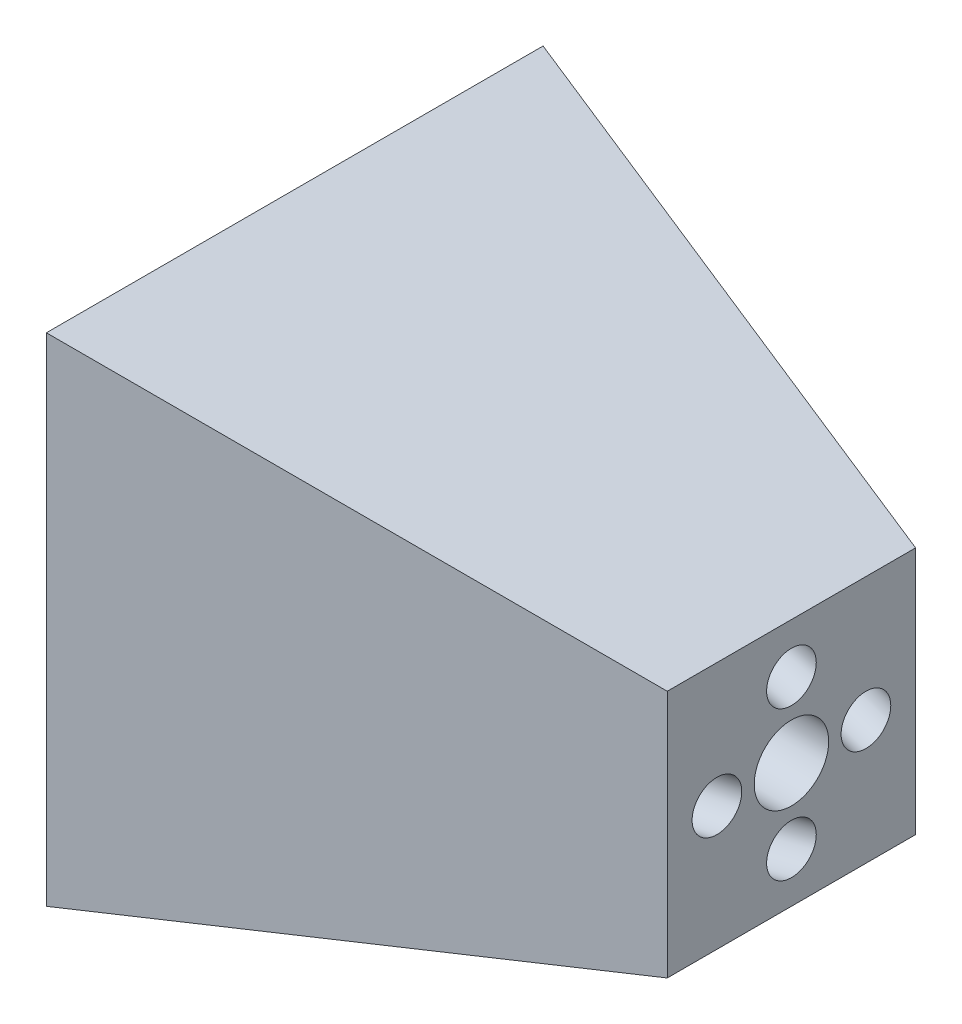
from build123d import *

# Parameters (mm, degrees)
SKETCH3_R          = 5
SKETCH6_R          = 5
SKETCH7_R          = 7.5
CUT_EXTRUDE1_DEPTH = 123.474487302


with BuildPart() as part:
    # Sketch1 → Loft1 section 0
    with BuildSketch(Plane(origin=(0, 0, 0), x_dir=(0, 0, -1), z_dir=(1, 0, 0))):
        with BuildLine():
            Line((25, 25), (-25, 25))
            Line((-25, 25), (-25, -25))
            Line((-25, -25), (25, -25))
            Line((25, -25), (25, 25))
        make_face()
    # Sketch2 → Loft1 section 1
    with BuildSketch(Plane(origin=(-100, 0, 0), x_dir=(0, 0, -1), z_dir=(1, 0, 0))):
        with BuildLine():
            Line((50, 50), (-50, 50))
            Line((-50, 50), (-50, -50))
            Line((-50, -50), (50, -50))
            Line((50, -50), (50, 50))
        make_face()
    loft()

    # Cut-Sweep2: sweep along a path in Sketch4
    with BuildLine(Plane(origin=(0, 0, 0), x_dir=(1, 0, 0), z_dir=(0, 1, 0))) as cut_sweep2_path:
        Line((0, 15), (-100, 40))
    # Sketch3 → Cut-Sweep2 (sweep, cut)
    with BuildSketch(Plane(origin=(0, 0, 0), x_dir=(0, 0, -1), z_dir=(1, 0, 0))):
        with Locations((15, 0)):
            Circle(SKETCH3_R)
    cut_sweep2 = sweep(path=cut_sweep2_path.line, mode=Mode.SUBTRACT)

    # Cut-Sweep3: sweep along a path in Sketch5
    with BuildLine(Plane.XY) as cut_sweep3_path:
        Line((0, 15), (-100, 40))
    # Sketch6 → Cut-Sweep3 (sweep, cut)
    with BuildSketch(Plane(origin=(0, 0, 0), x_dir=(0, 0, -1), z_dir=(1, 0, 0))):
        with Locations((0, 15)):
            Circle(SKETCH6_R)
    cut_sweep3 = sweep(path=cut_sweep3_path.line, mode=Mode.SUBTRACT)

    # Mirror1: Cut-Sweep2 across plane
    add(cut_sweep2.mirror(Plane.XY), mode=Mode.SUBTRACT)

    # Mirror2: Cut-Sweep3 across plane
    add(cut_sweep3.mirror(Plane.ZX), mode=Mode.SUBTRACT)

    # Sketch7 → Cut-Extrude1 (cut, through all)
    with BuildSketch(Plane(origin=(0, 0, 0), x_dir=(0, 0, -1), z_dir=(1, 0, 0))):
        Circle(SKETCH7_R)
    extrude(amount=-CUT_EXTRUDE1_DEPTH, mode=Mode.SUBTRACT)


solid = part.part
